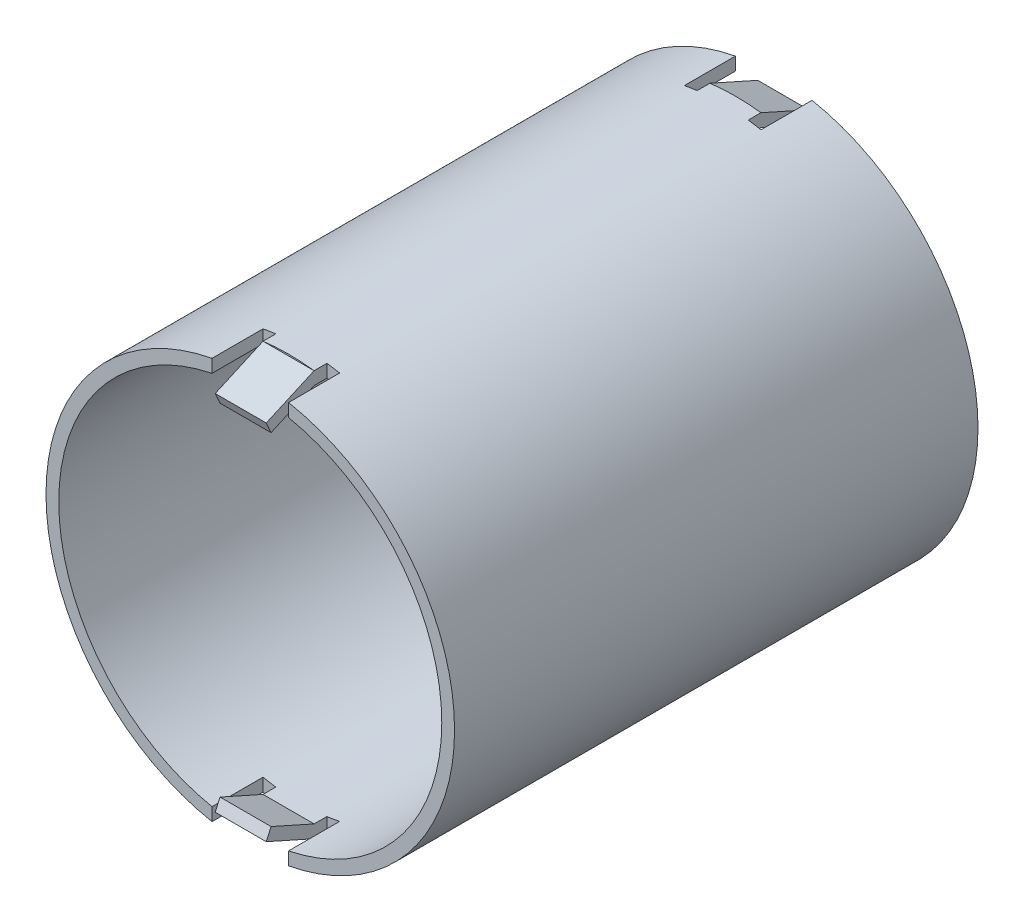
ISO-10303-21;
HEADER;
FILE_DESCRIPTION(('STEP AP214'),'2;1');
FILE_NAME('part.step','',(''),(''),'','','');
FILE_SCHEMA(('AUTOMOTIVE_DESIGN { 1 0 10303 214 1 1 1 1 }'));
ENDSEC;
DATA;
#1=APPLICATION_CONTEXT('core data for automotive mechanical design processes');
#2=APPLICATION_PROTOCOL_DEFINITION('international standard','automotive_design',2000,#1);
#3=PRODUCT_CONTEXT('',#1,'mechanical');
#4=PRODUCT('Part','Part','',(#3));
#5=PRODUCT_RELATED_PRODUCT_CATEGORY('part','',(#4));
#6=PRODUCT_DEFINITION_FORMATION('','',#4);
#7=PRODUCT_DEFINITION_CONTEXT('part definition',#1,'design');
#8=PRODUCT_DEFINITION('design','',#6,#7);
#9=PRODUCT_DEFINITION_SHAPE('','',#8);
#10=(LENGTH_UNIT() NAMED_UNIT(*) SI_UNIT(.MILLI.,.METRE.));
#11=(NAMED_UNIT(*) PLANE_ANGLE_UNIT() SI_UNIT($,.RADIAN.));
#12=(NAMED_UNIT(*) SI_UNIT($,.STERADIAN.) SOLID_ANGLE_UNIT());
#13=UNCERTAINTY_MEASURE_WITH_UNIT(LENGTH_MEASURE(1.E-05),#10,'distance_accuracy_value','');
#14=(GEOMETRIC_REPRESENTATION_CONTEXT(3) GLOBAL_UNCERTAINTY_ASSIGNED_CONTEXT((#13)) GLOBAL_UNIT_ASSIGNED_CONTEXT((#10,
#11,#12)) REPRESENTATION_CONTEXT('',''));
#15=CARTESIAN_POINT('',(0.,0.,0.));
#16=DIRECTION('',(0.,0.,1.));
#17=DIRECTION('',(1.,0.,0.));
#18=AXIS2_PLACEMENT_3D('',#15,#16,#17);
#19=CARTESIAN_POINT('',(-2.,-16.,38.));
#20=DIRECTION('',(0.,0.,1.));
#21=DIRECTION('',(1.,0.,0.));
#22=AXIS2_PLACEMENT_3D('',#19,#20,#21);
#23=PLANE('',#22);
#24=CARTESIAN_POINT('',(0.,0.,38.));
#25=DIRECTION('',(0.,0.,1.));
#26=DIRECTION('',(1.,0.,0.));
#27=AXIS2_PLACEMENT_3D('',#24,#25,#26);
#28=CIRCLE('',#27,16.);
#29=CARTESIAN_POINT('',(-1.9999999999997,-15.8745078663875,38.));
#30=VERTEX_POINT('',#29);
#31=CARTESIAN_POINT('',(2.0000000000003,-15.8745078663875,38.));
#32=VERTEX_POINT('',#31);
#33=EDGE_CURVE('E300',#30,#32,#28,.T.);
#34=ORIENTED_EDGE('',*,*,#33,.T.);
#35=DIRECTION('',(-1.,0.,0.));
#36=VECTOR('',#35,1.);
#37=CARTESIAN_POINT('',(2.0000000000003,-15.8745078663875,38.));
#38=LINE('',#37,#36);
#39=EDGE_CURVE('E289',#32,#30,#38,.T.);
#40=ORIENTED_EDGE('',*,*,#39,.T.);
#41=EDGE_LOOP('',(#34,#40));
#42=FACE_BOUND('',#41,.T.);
#43=ADVANCED_FACE('F27',(#42),#23,.T.);
#44=CARTESIAN_POINT('',(2.,15.8745078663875,38.));
#45=VERTEX_POINT('',#44);
#46=CARTESIAN_POINT('',(-2.,15.8745078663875,38.));
#47=VERTEX_POINT('',#46);
#48=EDGE_CURVE('E313',#45,#47,#28,.T.);
#49=ORIENTED_EDGE('',*,*,#48,.T.);
#50=DIRECTION('',(1.,0.,0.));
#51=VECTOR('',#50,1.);
#52=CARTESIAN_POINT('',(-2.,15.8745078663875,38.));
#53=LINE('',#52,#51);
#54=EDGE_CURVE('E478',#47,#45,#53,.T.);
#55=ORIENTED_EDGE('',*,*,#54,.T.);
#56=EDGE_LOOP('',(#49,#55));
#57=FACE_BOUND('',#56,.T.);
#58=ADVANCED_FACE('F595',(#57),#23,.T.);
#59=CARTESIAN_POINT('',(0.,0.,41.));
#60=DIRECTION('',(0.,0.,1.));
#61=DIRECTION('',(1.,0.,0.));
#62=AXIS2_PLACEMENT_3D('',#59,#60,#61);
#63=PLANE('',#62);
#64=CARTESIAN_POINT('',(0.,0.,41.));
#65=DIRECTION('',(0.,0.,1.));
#66=DIRECTION('',(1.,0.,0.));
#67=AXIS2_PLACEMENT_3D('',#64,#65,#66);
#68=CIRCLE('',#67,16.);
#69=CARTESIAN_POINT('',(-2.99999999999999,15.7162336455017,41.));
#70=VERTEX_POINT('',#69);
#71=CARTESIAN_POINT('',(-2.99999999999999,-15.7162336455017,41.));
#72=VERTEX_POINT('',#71);
#73=EDGE_CURVE('E405',#70,#72,#68,.T.);
#74=ORIENTED_EDGE('',*,*,#73,.T.);
#75=DIRECTION('',(0.,1.,0.));
#76=VECTOR('',#75,1.);
#77=CARTESIAN_POINT('',(-2.99999999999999,-16.,41.));
#78=LINE('',#77,#76);
#79=CARTESIAN_POINT('',(-2.99999999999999,-14.6969384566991,41.));
#80=VERTEX_POINT('',#79);
#81=EDGE_CURVE('E573',#72,#80,#78,.T.);
#82=ORIENTED_EDGE('',*,*,#81,.T.);
#83=CARTESIAN_POINT('',(0.,0.,41.));
#84=DIRECTION('',(0.,0.,1.));
#85=DIRECTION('',(1.,0.,0.));
#86=AXIS2_PLACEMENT_3D('',#83,#84,#85);
#87=CIRCLE('',#86,15.);
#88=CARTESIAN_POINT('',(-2.99999999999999,14.6969384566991,41.));
#89=VERTEX_POINT('',#88);
#90=EDGE_CURVE('E397',#89,#80,#87,.T.);
#91=ORIENTED_EDGE('',*,*,#90,.F.);
#92=EDGE_CURVE('E551',#89,#70,#78,.T.);
#93=ORIENTED_EDGE('',*,*,#92,.T.);
#94=EDGE_LOOP('',(#74,#82,#91,#93));
#95=FACE_BOUND('',#94,.T.);
#96=ADVANCED_FACE('F646',(#95),#63,.T.);
#97=CARTESIAN_POINT('',(2.99999999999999,-15.7162336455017,41.));
#98=VERTEX_POINT('',#97);
#99=CARTESIAN_POINT('',(2.99999999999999,15.7162336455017,41.));
#100=VERTEX_POINT('',#99);
#101=EDGE_CURVE('E402',#98,#100,#68,.T.);
#102=ORIENTED_EDGE('',*,*,#101,.T.);
#103=DIRECTION('',(0.,1.,0.));
#104=VECTOR('',#103,1.);
#105=CARTESIAN_POINT('',(2.99999999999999,-16.,41.));
#106=LINE('',#105,#104);
#107=CARTESIAN_POINT('',(2.99999999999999,14.6969384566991,41.));
#108=VERTEX_POINT('',#107);
#109=EDGE_CURVE('E571',#108,#100,#106,.T.);
#110=ORIENTED_EDGE('',*,*,#109,.F.);
#111=CARTESIAN_POINT('',(2.99999999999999,-14.6969384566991,41.));
#112=VERTEX_POINT('',#111);
#113=EDGE_CURVE('E394',#112,#108,#87,.T.);
#114=ORIENTED_EDGE('',*,*,#113,.F.);
#115=EDGE_CURVE('E50',#98,#112,#106,.T.);
#116=ORIENTED_EDGE('',*,*,#115,.F.);
#117=EDGE_LOOP('',(#102,#110,#114,#116));
#118=FACE_BOUND('',#117,.T.);
#119=ADVANCED_FACE('F710',(#118),#63,.T.);
#120=CARTESIAN_POINT('',(0.,0.,41.));
#121=DIRECTION('',(0.,0.,-1.));
#122=DIRECTION('',(-1.,0.,0.));
#123=AXIS2_PLACEMENT_3D('',#120,#121,#122);
#124=CYLINDRICAL_SURFACE('',#123,16.);
#125=CARTESIAN_POINT('',(0.,0.,0.));
#126=DIRECTION('',(0.,0.,1.));
#127=DIRECTION('',(1.,0.,0.));
#128=AXIS2_PLACEMENT_3D('',#125,#126,#127);
#129=CIRCLE('',#128,16.);
#130=CARTESIAN_POINT('',(2.99999999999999,-15.7162336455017,0.));
#131=VERTEX_POINT('',#130);
#132=CARTESIAN_POINT('',(2.99999999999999,15.7162336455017,0.));
#133=VERTEX_POINT('',#132);
#134=EDGE_CURVE('E398',#131,#133,#129,.T.);
#135=ORIENTED_EDGE('',*,*,#134,.T.);
#136=DIRECTION('',(0.,0.,-1.));
#137=VECTOR('',#136,1.);
#138=CARTESIAN_POINT('',(2.99999999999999,15.7162336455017,41.));
#139=LINE('',#138,#137);
#140=CARTESIAN_POINT('',(2.99999999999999,15.7162336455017,4.));
#141=VERTEX_POINT('',#140);
#142=EDGE_CURVE('E378',#133,#141,#139,.F.);
#143=ORIENTED_EDGE('',*,*,#142,.T.);
#144=CARTESIAN_POINT('',(0.,0.,4.));
#145=DIRECTION('',(0.,0.,1.));
#146=DIRECTION('',(1.,0.,0.));
#147=AXIS2_PLACEMENT_3D('',#144,#145,#146);
#148=CIRCLE('',#147,16.);
#149=CARTESIAN_POINT('',(2.,15.8745078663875,3.99999999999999));
#150=VERTEX_POINT('',#149);
#151=EDGE_CURVE('E377',#141,#150,#148,.T.);
#152=ORIENTED_EDGE('',*,*,#151,.T.);
#153=DIRECTION('',(0.,0.,-1.));
#154=VECTOR('',#153,1.);
#155=CARTESIAN_POINT('',(2.00000000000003,15.8745078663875,41.));
#156=LINE('',#155,#154);
#157=CARTESIAN_POINT('',(2.,15.8745078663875,3.));
#158=VERTEX_POINT('',#157);
#159=EDGE_CURVE('E371',#150,#158,#156,.T.);
#160=ORIENTED_EDGE('',*,*,#159,.T.);
#161=CARTESIAN_POINT('',(0.,0.,3.));
#162=DIRECTION('',(0.,0.,1.));
#163=DIRECTION('',(1.,0.,0.));
#164=AXIS2_PLACEMENT_3D('',#161,#162,#163);
#165=CIRCLE('',#164,16.);
#166=CARTESIAN_POINT('',(-2.,15.8745078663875,3.));
#167=VERTEX_POINT('',#166);
#168=EDGE_CURVE('E365',#158,#167,#165,.T.);
#169=ORIENTED_EDGE('',*,*,#168,.T.);
#170=DIRECTION('',(0.,0.,-1.));
#171=VECTOR('',#170,1.);
#172=CARTESIAN_POINT('',(-2.,15.8745078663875,41.));
#173=LINE('',#172,#171);
#174=CARTESIAN_POINT('',(-2.,15.8745078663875,3.99999999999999));
#175=VERTEX_POINT('',#174);
#176=EDGE_CURVE('E358',#167,#175,#173,.F.);
#177=ORIENTED_EDGE('',*,*,#176,.T.);
#178=CARTESIAN_POINT('',(0.,0.,3.99999999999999));
#179=DIRECTION('',(0.,0.,1.));
#180=DIRECTION('',(1.,0.,0.));
#181=AXIS2_PLACEMENT_3D('',#178,#179,#180);
#182=CIRCLE('',#181,16.);
#183=CARTESIAN_POINT('',(-2.99999999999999,15.7162336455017,3.99999999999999));
#184=VERTEX_POINT('',#183);
#185=EDGE_CURVE('E357',#175,#184,#182,.T.);
#186=ORIENTED_EDGE('',*,*,#185,.T.);
#187=DIRECTION('',(0.,0.,-1.));
#188=VECTOR('',#187,1.);
#189=CARTESIAN_POINT('',(-2.99999999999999,15.7162336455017,41.));
#190=LINE('',#189,#188);
#191=CARTESIAN_POINT('',(-2.99999999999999,15.7162336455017,0.));
#192=VERTEX_POINT('',#191);
#193=EDGE_CURVE('E387',#184,#192,#190,.T.);
#194=ORIENTED_EDGE('',*,*,#193,.T.);
#195=CARTESIAN_POINT('',(-2.99999999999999,-15.7162336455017,0.));
#196=VERTEX_POINT('',#195);
#197=EDGE_CURVE('E401',#192,#196,#129,.T.);
#198=ORIENTED_EDGE('',*,*,#197,.T.);
#199=DIRECTION('',(0.,0.,-1.));
#200=VECTOR('',#199,1.);
#201=CARTESIAN_POINT('',(-2.99999999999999,-15.7162336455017,41.));
#202=LINE('',#201,#200);
#203=CARTESIAN_POINT('',(-2.99999999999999,-15.7162336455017,3.99999999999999));
#204=VERTEX_POINT('',#203);
#205=EDGE_CURVE('E384',#196,#204,#202,.F.);
#206=ORIENTED_EDGE('',*,*,#205,.T.);
#207=CARTESIAN_POINT('',(-2.,-15.8745078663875,3.99999999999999));
#208=VERTEX_POINT('',#207);
#209=EDGE_CURVE('E354',#204,#208,#182,.T.);
#210=ORIENTED_EDGE('',*,*,#209,.T.);
#211=DIRECTION('',(0.,0.,-1.));
#212=VECTOR('',#211,1.);
#213=CARTESIAN_POINT('',(-2.,-15.8745078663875,41.));
#214=LINE('',#213,#212);
#215=CARTESIAN_POINT('',(-1.9999999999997,-15.8745078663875,3.));
#216=VERTEX_POINT('',#215);
#217=EDGE_CURVE('E361',#208,#216,#214,.T.);
#218=ORIENTED_EDGE('',*,*,#217,.T.);
#219=CARTESIAN_POINT('',(2.0000000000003,-15.8745078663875,3.));
#220=VERTEX_POINT('',#219);
#221=EDGE_CURVE('E364',#216,#220,#165,.T.);
#222=ORIENTED_EDGE('',*,*,#221,.T.);
#223=DIRECTION('',(0.,0.,-1.));
#224=VECTOR('',#223,1.);
#225=CARTESIAN_POINT('',(2.00000000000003,-15.8745078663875,41.));
#226=LINE('',#225,#224);
#227=CARTESIAN_POINT('',(2.,-15.8745078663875,3.99999999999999));
#228=VERTEX_POINT('',#227);
#229=EDGE_CURVE('E368',#220,#228,#226,.F.);
#230=ORIENTED_EDGE('',*,*,#229,.T.);
#231=CARTESIAN_POINT('',(2.99999999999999,-15.7162336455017,4.));
#232=VERTEX_POINT('',#231);
#233=EDGE_CURVE('E374',#228,#232,#148,.T.);
#234=ORIENTED_EDGE('',*,*,#233,.T.);
#235=DIRECTION('',(0.,0.,-1.));
#236=VECTOR('',#235,1.);
#237=CARTESIAN_POINT('',(2.99999999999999,-15.7162336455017,41.));
#238=LINE('',#237,#236);
#239=EDGE_CURVE('E381',#232,#131,#238,.T.);
#240=ORIENTED_EDGE('',*,*,#239,.T.);
#241=EDGE_LOOP('',(#135,#143,#152,#160,#169,#177,#186,#194,#198,#206,#210,#218,#222,#230,#234,#240));
#242=FACE_BOUND('',#241,.T.);
#243=DIRECTION('',(0.,0.,-1.));
#244=VECTOR('',#243,1.);
#245=CARTESIAN_POINT('',(-2.99999999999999,-15.7162336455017,41.));
#246=LINE('',#245,#244);
#247=CARTESIAN_POINT('',(-2.99999999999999,-15.7162336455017,37.));
#248=VERTEX_POINT('',#247);
#249=EDGE_CURVE('E329',#72,#248,#246,.T.);
#250=ORIENTED_EDGE('',*,*,#249,.F.);
#251=ORIENTED_EDGE('',*,*,#73,.F.);
#252=DIRECTION('',(0.,0.,-1.));
#253=VECTOR('',#252,1.);
#254=CARTESIAN_POINT('',(-2.99999999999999,15.7162336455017,41.));
#255=LINE('',#254,#253);
#256=CARTESIAN_POINT('',(-2.99999999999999,15.7162336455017,37.));
#257=VERTEX_POINT('',#256);
#258=EDGE_CURVE('E327',#257,#70,#255,.F.);
#259=ORIENTED_EDGE('',*,*,#258,.F.);
#260=CARTESIAN_POINT('',(0.,0.,37.));
#261=DIRECTION('',(0.,0.,1.));
#262=DIRECTION('',(1.,0.,0.));
#263=AXIS2_PLACEMENT_3D('',#260,#261,#262);
#264=CIRCLE('',#263,16.);
#265=CARTESIAN_POINT('',(-2.,15.8745078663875,37.));
#266=VERTEX_POINT('',#265);
#267=EDGE_CURVE('E326',#266,#257,#264,.T.);
#268=ORIENTED_EDGE('',*,*,#267,.F.);
#269=DIRECTION('',(0.,0.,-1.));
#270=VECTOR('',#269,1.);
#271=CARTESIAN_POINT('',(-2.,15.8745078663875,41.));
#272=LINE('',#271,#270);
#273=EDGE_CURVE('E312',#47,#266,#272,.T.);
#274=ORIENTED_EDGE('',*,*,#273,.F.);
#275=ORIENTED_EDGE('',*,*,#48,.F.);
#276=DIRECTION('',(0.,0.,-1.));
#277=VECTOR('',#276,1.);
#278=CARTESIAN_POINT('',(1.99999999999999,15.8745078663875,41.));
#279=LINE('',#278,#277);
#280=CARTESIAN_POINT('',(2.,15.8745078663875,37.));
#281=VERTEX_POINT('',#280);
#282=EDGE_CURVE('E319',#281,#45,#279,.F.);
#283=ORIENTED_EDGE('',*,*,#282,.F.);
#284=CARTESIAN_POINT('',(0.,0.,37.));
#285=DIRECTION('',(0.,0.,1.));
#286=DIRECTION('',(1.,0.,0.));
#287=AXIS2_PLACEMENT_3D('',#284,#285,#286);
#288=CIRCLE('',#287,16.);
#289=CARTESIAN_POINT('',(2.99999999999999,15.7162336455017,37.));
#290=VERTEX_POINT('',#289);
#291=EDGE_CURVE('E581',#290,#281,#288,.T.);
#292=ORIENTED_EDGE('',*,*,#291,.F.);
#293=DIRECTION('',(0.,0.,-1.));
#294=VECTOR('',#293,1.);
#295=CARTESIAN_POINT('',(2.99999999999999,15.7162336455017,41.));
#296=LINE('',#295,#294);
#297=EDGE_CURVE('E578',#100,#290,#296,.T.);
#298=ORIENTED_EDGE('',*,*,#297,.F.);
#299=ORIENTED_EDGE('',*,*,#101,.F.);
#300=DIRECTION('',(0.,0.,-1.));
#301=VECTOR('',#300,1.);
#302=CARTESIAN_POINT('',(2.99999999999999,-15.7162336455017,41.));
#303=LINE('',#302,#301);
#304=CARTESIAN_POINT('',(2.99999999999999,-15.7162336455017,37.));
#305=VERTEX_POINT('',#304);
#306=EDGE_CURVE('E576',#305,#98,#303,.F.);
#307=ORIENTED_EDGE('',*,*,#306,.F.);
#308=CARTESIAN_POINT('',(2.,-15.8745078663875,37.));
#309=VERTEX_POINT('',#308);
#310=EDGE_CURVE('E580',#309,#305,#288,.T.);
#311=ORIENTED_EDGE('',*,*,#310,.F.);
#312=DIRECTION('',(0.,0.,-1.));
#313=VECTOR('',#312,1.);
#314=CARTESIAN_POINT('',(1.99999999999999,-15.8745078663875,41.));
#315=LINE('',#314,#313);
#316=EDGE_CURVE('E317',#32,#309,#315,.T.);
#317=ORIENTED_EDGE('',*,*,#316,.F.);
#318=ORIENTED_EDGE('',*,*,#33,.F.);
#319=DIRECTION('',(0.,0.,-1.));
#320=VECTOR('',#319,1.);
#321=CARTESIAN_POINT('',(-2.,-15.8745078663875,41.));
#322=LINE('',#321,#320);
#323=CARTESIAN_POINT('',(-2.,-15.8745078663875,37.));
#324=VERTEX_POINT('',#323);
#325=EDGE_CURVE('E306',#324,#30,#322,.F.);
#326=ORIENTED_EDGE('',*,*,#325,.F.);
#327=EDGE_CURVE('E324',#248,#324,#264,.T.);
#328=ORIENTED_EDGE('',*,*,#327,.F.);
#329=EDGE_LOOP('',(#250,#251,#259,#268,#274,#275,#283,#292,#298,#299,#307,#311,#317,#318,#326,#328));
#330=FACE_BOUND('',#329,.T.);
#331=ADVANCED_FACE('F29',(#242,#330),#124,.T.);
#332=CARTESIAN_POINT('',(0.,0.,41.));
#333=DIRECTION('',(0.,0.,-1.));
#334=DIRECTION('',(-1.,0.,0.));
#335=AXIS2_PLACEMENT_3D('',#332,#333,#334);
#336=CYLINDRICAL_SURFACE('',#335,15.);
#337=DIRECTION('',(0.,0.,-1.));
#338=VECTOR('',#337,1.);
#339=CARTESIAN_POINT('',(-2.99999999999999,14.6969384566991,41.));
#340=LINE('',#339,#338);
#341=CARTESIAN_POINT('',(-2.99999999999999,14.6969384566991,3.99999999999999));
#342=VERTEX_POINT('',#341);
#343=CARTESIAN_POINT('',(-2.99999999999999,14.6969384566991,0.));
#344=VERTEX_POINT('',#343);
#345=EDGE_CURVE('E433',#342,#344,#340,.T.);
#346=ORIENTED_EDGE('',*,*,#345,.F.);
#347=CARTESIAN_POINT('',(0.,0.,3.99999999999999));
#348=DIRECTION('',(0.,0.,1.));
#349=DIRECTION('',(1.,0.,0.));
#350=AXIS2_PLACEMENT_3D('',#347,#348,#349);
#351=CIRCLE('',#350,15.);
#352=CARTESIAN_POINT('',(-2.,14.8660687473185,3.99999999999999));
#353=VERTEX_POINT('',#352);
#354=EDGE_CURVE('E409',#353,#342,#351,.T.);
#355=ORIENTED_EDGE('',*,*,#354,.F.);
#356=DIRECTION('',(0.,0.,-1.));
#357=VECTOR('',#356,1.);
#358=CARTESIAN_POINT('',(-2.,14.8660687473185,41.));
#359=LINE('',#358,#357);
#360=CARTESIAN_POINT('',(-2.,14.8660687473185,2.99999999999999));
#361=VERTEX_POINT('',#360);
#362=EDGE_CURVE('E426',#361,#353,#359,.F.);
#363=ORIENTED_EDGE('',*,*,#362,.F.);
#364=CARTESIAN_POINT('',(0.,0.,3.));
#365=DIRECTION('',(0.,0.,1.));
#366=DIRECTION('',(1.,0.,0.));
#367=AXIS2_PLACEMENT_3D('',#364,#365,#366);
#368=CIRCLE('',#367,15.);
#369=CARTESIAN_POINT('',(2.,14.8660687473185,3.));
#370=VERTEX_POINT('',#369);
#371=EDGE_CURVE('E416',#370,#361,#368,.T.);
#372=ORIENTED_EDGE('',*,*,#371,.F.);
#373=DIRECTION('',(0.,0.,-1.));
#374=VECTOR('',#373,1.);
#375=CARTESIAN_POINT('',(2.00000000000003,14.8660687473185,41.));
#376=LINE('',#375,#374);
#377=CARTESIAN_POINT('',(2.,14.8660687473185,3.99999999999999));
#378=VERTEX_POINT('',#377);
#379=EDGE_CURVE('E429',#378,#370,#376,.T.);
#380=ORIENTED_EDGE('',*,*,#379,.F.);
#381=CARTESIAN_POINT('',(0.,0.,4.));
#382=DIRECTION('',(0.,0.,1.));
#383=DIRECTION('',(1.,0.,0.));
#384=AXIS2_PLACEMENT_3D('',#381,#382,#383);
#385=CIRCLE('',#384,15.);
#386=CARTESIAN_POINT('',(2.99999999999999,14.6969384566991,4.));
#387=VERTEX_POINT('',#386);
#388=EDGE_CURVE('E421',#387,#378,#385,.T.);
#389=ORIENTED_EDGE('',*,*,#388,.F.);
#390=DIRECTION('',(0.,0.,-1.));
#391=VECTOR('',#390,1.);
#392=CARTESIAN_POINT('',(2.99999999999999,14.6969384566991,41.));
#393=LINE('',#392,#391);
#394=CARTESIAN_POINT('',(2.99999999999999,14.6969384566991,0.));
#395=VERTEX_POINT('',#394);
#396=EDGE_CURVE('E431',#395,#387,#393,.F.);
#397=ORIENTED_EDGE('',*,*,#396,.F.);
#398=CARTESIAN_POINT('',(0.,0.,0.));
#399=DIRECTION('',(0.,0.,1.));
#400=DIRECTION('',(1.,0.,0.));
#401=AXIS2_PLACEMENT_3D('',#398,#399,#400);
#402=CIRCLE('',#401,15.);
#403=CARTESIAN_POINT('',(2.99999999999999,-14.6969384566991,0.));
#404=VERTEX_POINT('',#403);
#405=EDGE_CURVE('E390',#404,#395,#402,.T.);
#406=ORIENTED_EDGE('',*,*,#405,.F.);
#407=DIRECTION('',(0.,0.,-1.));
#408=VECTOR('',#407,1.);
#409=CARTESIAN_POINT('',(2.99999999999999,-14.6969384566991,41.));
#410=LINE('',#409,#408);
#411=CARTESIAN_POINT('',(2.99999999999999,-14.6969384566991,4.));
#412=VERTEX_POINT('',#411);
#413=EDGE_CURVE('E420',#412,#404,#410,.T.);
#414=ORIENTED_EDGE('',*,*,#413,.F.);
#415=CARTESIAN_POINT('',(2.,-14.8660687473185,3.99999999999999));
#416=VERTEX_POINT('',#415);
#417=EDGE_CURVE('E418',#416,#412,#385,.T.);
#418=ORIENTED_EDGE('',*,*,#417,.F.);
#419=DIRECTION('',(0.,0.,-1.));
#420=VECTOR('',#419,1.);
#421=CARTESIAN_POINT('',(2.00000000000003,-14.8660687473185,41.));
#422=LINE('',#421,#420);
#423=CARTESIAN_POINT('',(2.,-14.8660687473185,3.));
#424=VERTEX_POINT('',#423);
#425=EDGE_CURVE('E415',#424,#416,#422,.F.);
#426=ORIENTED_EDGE('',*,*,#425,.F.);
#427=CARTESIAN_POINT('',(-1.99999999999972,-14.8660687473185,3.));
#428=VERTEX_POINT('',#427);
#429=EDGE_CURVE('E412',#428,#424,#368,.T.);
#430=ORIENTED_EDGE('',*,*,#429,.F.);
#431=DIRECTION('',(0.,0.,-1.));
#432=VECTOR('',#431,1.);
#433=CARTESIAN_POINT('',(-2.,-14.8660687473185,41.));
#434=LINE('',#433,#432);
#435=CARTESIAN_POINT('',(-2.,-14.8660687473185,3.99999999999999));
#436=VERTEX_POINT('',#435);
#437=EDGE_CURVE('E408',#436,#428,#434,.T.);
#438=ORIENTED_EDGE('',*,*,#437,.F.);
#439=CARTESIAN_POINT('',(-2.99999999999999,-14.6969384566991,3.99999999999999));
#440=VERTEX_POINT('',#439);
#441=EDGE_CURVE('E406',#440,#436,#351,.T.);
#442=ORIENTED_EDGE('',*,*,#441,.F.);
#443=DIRECTION('',(0.,0.,-1.));
#444=VECTOR('',#443,1.);
#445=CARTESIAN_POINT('',(-2.99999999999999,-14.6969384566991,41.));
#446=LINE('',#445,#444);
#447=CARTESIAN_POINT('',(-2.99999999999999,-14.6969384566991,0.));
#448=VERTEX_POINT('',#447);
#449=EDGE_CURVE('E423',#448,#440,#446,.F.);
#450=ORIENTED_EDGE('',*,*,#449,.F.);
#451=EDGE_CURVE('E393',#344,#448,#402,.T.);
#452=ORIENTED_EDGE('',*,*,#451,.F.);
#453=EDGE_LOOP('',(#346,#355,#363,#372,#380,#389,#397,#406,#414,#418,#426,#430,#438,#442,#450,#452));
#454=FACE_BOUND('',#453,.T.);
#455=CARTESIAN_POINT('',(0.,0.,37.));
#456=DIRECTION('',(0.,0.,1.));
#457=DIRECTION('',(1.,0.,0.));
#458=AXIS2_PLACEMENT_3D('',#455,#456,#457);
#459=CIRCLE('',#458,15.);
#460=CARTESIAN_POINT('',(-2.,14.8660687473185,37.));
#461=VERTEX_POINT('',#460);
#462=CARTESIAN_POINT('',(-2.99999999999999,14.6969384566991,37.));
#463=VERTEX_POINT('',#462);
#464=EDGE_CURVE('E35',#461,#463,#459,.T.);
#465=ORIENTED_EDGE('',*,*,#464,.T.);
#466=DIRECTION('',(0.,0.,-1.));
#467=VECTOR('',#466,1.);
#468=CARTESIAN_POINT('',(-2.99999999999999,14.6969384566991,41.));
#469=LINE('',#468,#467);
#470=EDGE_CURVE('E11',#463,#89,#469,.F.);
#471=ORIENTED_EDGE('',*,*,#470,.T.);
#472=ORIENTED_EDGE('',*,*,#90,.T.);
#473=DIRECTION('',(0.,0.,-1.));
#474=VECTOR('',#473,1.);
#475=CARTESIAN_POINT('',(-2.99999999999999,-14.6969384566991,41.));
#476=LINE('',#475,#474);
#477=CARTESIAN_POINT('',(-2.99999999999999,-14.6969384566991,37.));
#478=VERTEX_POINT('',#477);
#479=EDGE_CURVE('E454',#80,#478,#476,.T.);
#480=ORIENTED_EDGE('',*,*,#479,.T.);
#481=CARTESIAN_POINT('',(-2.,-14.8660687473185,37.));
#482=VERTEX_POINT('',#481);
#483=EDGE_CURVE('E451',#478,#482,#459,.T.);
#484=ORIENTED_EDGE('',*,*,#483,.T.);
#485=DIRECTION('',(0.,0.,-1.));
#486=VECTOR('',#485,1.);
#487=CARTESIAN_POINT('',(-2.,-14.8660687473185,41.));
#488=LINE('',#487,#486);
#489=CARTESIAN_POINT('',(-2.,-14.8660687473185,38.));
#490=VERTEX_POINT('',#489);
#491=EDGE_CURVE('E447',#482,#490,#488,.F.);
#492=ORIENTED_EDGE('',*,*,#491,.T.);
#493=CARTESIAN_POINT('',(0.,0.,38.));
#494=DIRECTION('',(0.,0.,1.));
#495=DIRECTION('',(1.,0.,0.));
#496=AXIS2_PLACEMENT_3D('',#493,#494,#495);
#497=CIRCLE('',#496,15.);
#498=CARTESIAN_POINT('',(2.00000000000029,-14.8660687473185,38.));
#499=VERTEX_POINT('',#498);
#500=EDGE_CURVE('E444',#490,#499,#497,.T.);
#501=ORIENTED_EDGE('',*,*,#500,.T.);
#502=DIRECTION('',(0.,0.,-1.));
#503=VECTOR('',#502,1.);
#504=CARTESIAN_POINT('',(1.99999999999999,-14.8660687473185,41.));
#505=LINE('',#504,#503);
#506=CARTESIAN_POINT('',(2.,-14.8660687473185,37.));
#507=VERTEX_POINT('',#506);
#508=EDGE_CURVE('E440',#499,#507,#505,.T.);
#509=ORIENTED_EDGE('',*,*,#508,.T.);
#510=CARTESIAN_POINT('',(0.,0.,37.));
#511=DIRECTION('',(0.,0.,1.));
#512=DIRECTION('',(1.,0.,0.));
#513=AXIS2_PLACEMENT_3D('',#510,#511,#512);
#514=CIRCLE('',#513,15.);
#515=CARTESIAN_POINT('',(2.99999999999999,-14.6969384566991,37.));
#516=VERTEX_POINT('',#515);
#517=EDGE_CURVE('E437',#507,#516,#514,.T.);
#518=ORIENTED_EDGE('',*,*,#517,.T.);
#519=DIRECTION('',(0.,0.,-1.));
#520=VECTOR('',#519,1.);
#521=CARTESIAN_POINT('',(2.99999999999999,-14.6969384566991,41.));
#522=LINE('',#521,#520);
#523=EDGE_CURVE('E435',#516,#112,#522,.F.);
#524=ORIENTED_EDGE('',*,*,#523,.T.);
#525=ORIENTED_EDGE('',*,*,#113,.T.);
#526=DIRECTION('',(0.,0.,-1.));
#527=VECTOR('',#526,1.);
#528=CARTESIAN_POINT('',(2.99999999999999,14.6969384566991,41.));
#529=LINE('',#528,#527);
#530=CARTESIAN_POINT('',(2.99999999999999,14.6969384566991,37.));
#531=VERTEX_POINT('',#530);
#532=EDGE_CURVE('E457',#108,#531,#529,.T.);
#533=ORIENTED_EDGE('',*,*,#532,.T.);
#534=CARTESIAN_POINT('',(2.,14.8660687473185,37.));
#535=VERTEX_POINT('',#534);
#536=EDGE_CURVE('E441',#531,#535,#514,.T.);
#537=ORIENTED_EDGE('',*,*,#536,.T.);
#538=DIRECTION('',(0.,0.,-1.));
#539=VECTOR('',#538,1.);
#540=CARTESIAN_POINT('',(1.99999999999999,14.8660687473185,41.));
#541=LINE('',#540,#539);
#542=CARTESIAN_POINT('',(2.,14.8660687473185,38.));
#543=VERTEX_POINT('',#542);
#544=EDGE_CURVE('E460',#535,#543,#541,.F.);
#545=ORIENTED_EDGE('',*,*,#544,.T.);
#546=CARTESIAN_POINT('',(-2.,14.8660687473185,38.));
#547=VERTEX_POINT('',#546);
#548=EDGE_CURVE('E448',#543,#547,#497,.T.);
#549=ORIENTED_EDGE('',*,*,#548,.T.);
#550=DIRECTION('',(0.,0.,-1.));
#551=VECTOR('',#550,1.);
#552=CARTESIAN_POINT('',(-2.,14.8660687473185,41.));
#553=LINE('',#552,#551);
#554=EDGE_CURVE('E461',#547,#461,#553,.T.);
#555=ORIENTED_EDGE('',*,*,#554,.T.);
#556=EDGE_LOOP('',(#465,#471,#472,#480,#484,#492,#501,#509,#518,#524,#525,#533,#537,#545,#549,#555));
#557=FACE_BOUND('',#556,.T.);
#558=ADVANCED_FACE('F468',(#454,#557),#336,.F.);
#559=CARTESIAN_POINT('',(0.,0.,0.));
#560=DIRECTION('',(0.,0.,1.));
#561=DIRECTION('',(1.,0.,0.));
#562=AXIS2_PLACEMENT_3D('',#559,#560,#561);
#563=PLANE('',#562);
#564=ORIENTED_EDGE('',*,*,#197,.F.);
#565=DIRECTION('',(0.,1.,0.));
#566=VECTOR('',#565,1.);
#567=CARTESIAN_POINT('',(-2.99999999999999,-16.,0.));
#568=LINE('',#567,#566);
#569=EDGE_CURVE('E332',#344,#192,#568,.T.);
#570=ORIENTED_EDGE('',*,*,#569,.F.);
#571=ORIENTED_EDGE('',*,*,#451,.T.);
#572=EDGE_CURVE('E334',#196,#448,#568,.T.);
#573=ORIENTED_EDGE('',*,*,#572,.F.);
#574=EDGE_LOOP('',(#564,#570,#571,#573));
#575=FACE_BOUND('',#574,.T.);
#576=ADVANCED_FACE('F704',(#575),#563,.F.);
#577=ORIENTED_EDGE('',*,*,#134,.F.);
#578=DIRECTION('',(0.,1.,0.));
#579=VECTOR('',#578,1.);
#580=CARTESIAN_POINT('',(2.99999999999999,-16.,0.));
#581=LINE('',#580,#579);
#582=EDGE_CURVE('E335',#131,#404,#581,.T.);
#583=ORIENTED_EDGE('',*,*,#582,.T.);
#584=ORIENTED_EDGE('',*,*,#405,.T.);
#585=EDGE_CURVE('E336',#395,#133,#581,.T.);
#586=ORIENTED_EDGE('',*,*,#585,.T.);
#587=EDGE_LOOP('',(#577,#583,#584,#586));
#588=FACE_BOUND('',#587,.T.);
#589=ADVANCED_FACE('F706',(#588),#563,.F.);
#590=CARTESIAN_POINT('',(-2.99999999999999,-16.,3.99999999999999));
#591=DIRECTION('',(0.,0.,1.));
#592=DIRECTION('',(1.,0.,0.));
#593=AXIS2_PLACEMENT_3D('',#590,#591,#592);
#594=PLANE('',#593);
#595=DIRECTION('',(0.,1.,0.));
#596=VECTOR('',#595,1.);
#597=CARTESIAN_POINT('',(-2.99999999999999,-16.,3.99999999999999));
#598=LINE('',#597,#596);
#599=EDGE_CURVE('E351',#204,#440,#598,.T.);
#600=ORIENTED_EDGE('',*,*,#599,.T.);
#601=ORIENTED_EDGE('',*,*,#441,.T.);
#602=DIRECTION('',(0.,1.,0.));
#603=VECTOR('',#602,1.);
#604=CARTESIAN_POINT('',(-2.,-16.,3.99999999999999));
#605=LINE('',#604,#603);
#606=EDGE_CURVE('E347',#208,#436,#605,.T.);
#607=ORIENTED_EDGE('',*,*,#606,.F.);
#608=ORIENTED_EDGE('',*,*,#209,.F.);
#609=EDGE_LOOP('',(#600,#601,#607,#608));
#610=FACE_BOUND('',#609,.T.);
#611=ADVANCED_FACE('F692',(#610),#594,.F.);
#612=CARTESIAN_POINT('',(-2.,-16.,3.99999999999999));
#613=DIRECTION('',(1.,0.,0.));
#614=DIRECTION('',(0.,0.,-1.));
#615=AXIS2_PLACEMENT_3D('',#612,#613,#614);
#616=PLANE('',#615);
#617=ORIENTED_EDGE('',*,*,#606,.T.);
#618=ORIENTED_EDGE('',*,*,#437,.T.);
#619=DIRECTION('',(0.,0.407834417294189,-0.913055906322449));
#620=VECTOR('',#619,1.);
#621=CARTESIAN_POINT('',(-1.99999999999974,-13.3601481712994,-0.371441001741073));
#622=LINE('',#621,#620);
#623=CARTESIAN_POINT('',(-1.99999999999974,-13.3601481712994,-0.371441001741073));
#624=VERTEX_POINT('',#623);
#625=EDGE_CURVE('E499',#428,#624,#622,.T.);
#626=ORIENTED_EDGE('',*,*,#625,.T.);
#627=DIRECTION('',(0.,-0.913055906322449,-0.407834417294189));
#628=VECTOR('',#627,1.);
#629=CARTESIAN_POINT('',(-1.99999999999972,-14.2008547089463,-0.746959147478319));
#630=LINE('',#629,#628);
#631=CARTESIAN_POINT('',(-1.99999999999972,-14.2008547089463,-0.746959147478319));
#632=VERTEX_POINT('',#631);
#633=EDGE_CURVE('E507',#624,#632,#630,.T.);
#634=ORIENTED_EDGE('',*,*,#633,.T.);
#635=DIRECTION('',(0.,-0.40783441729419,0.913055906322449));
#636=VECTOR('',#635,1.);
#637=CARTESIAN_POINT('',(-1.9999999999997,-15.8745078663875,3.));
#638=LINE('',#637,#636);
#639=EDGE_CURVE('E510',#632,#216,#638,.T.);
#640=ORIENTED_EDGE('',*,*,#639,.T.);
#641=ORIENTED_EDGE('',*,*,#217,.F.);
#642=EDGE_LOOP('',(#617,#618,#626,#634,#640,#641));
#643=FACE_BOUND('',#642,.T.);
#644=ADVANCED_FACE('F689',(#643),#616,.F.);
#645=CARTESIAN_POINT('',(-2.,-16.,2.99999999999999));
#646=DIRECTION('',(0.,0.,1.));
#647=DIRECTION('',(1.,0.,0.));
#648=AXIS2_PLACEMENT_3D('',#645,#646,#647);
#649=PLANE('',#648);
#650=ORIENTED_EDGE('',*,*,#221,.F.);
#651=DIRECTION('',(-1.,0.,0.));
#652=VECTOR('',#651,1.);
#653=CARTESIAN_POINT('',(2.0000000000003,-15.8745078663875,3.));
#654=LINE('',#653,#652);
#655=EDGE_CURVE('E525',#220,#216,#654,.T.);
#656=ORIENTED_EDGE('',*,*,#655,.F.);
#657=EDGE_LOOP('',(#650,#656));
#658=FACE_BOUND('',#657,.T.);
#659=ADVANCED_FACE('F688',(#658),#649,.F.);
#660=CARTESIAN_POINT('',(2.,-16.,2.99999999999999));
#661=DIRECTION('',(-1.,0.,0.));
#662=DIRECTION('',(0.,0.,1.));
#663=AXIS2_PLACEMENT_3D('',#660,#661,#662);
#664=PLANE('',#663);
#665=ORIENTED_EDGE('',*,*,#229,.F.);
#666=DIRECTION('',(0.,-0.40783441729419,0.913055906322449));
#667=VECTOR('',#666,1.);
#668=CARTESIAN_POINT('',(2.0000000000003,-15.8745078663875,3.));
#669=LINE('',#668,#667);
#670=CARTESIAN_POINT('',(2.00000000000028,-14.2008547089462,-0.746959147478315));
#671=VERTEX_POINT('',#670);
#672=EDGE_CURVE('E519',#671,#220,#669,.T.);
#673=ORIENTED_EDGE('',*,*,#672,.F.);
#674=DIRECTION('',(0.,-0.913055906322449,-0.407834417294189));
#675=VECTOR('',#674,1.);
#676=CARTESIAN_POINT('',(2.00000000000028,-14.2008547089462,-0.746959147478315));
#677=LINE('',#676,#675);
#678=CARTESIAN_POINT('',(2.00000000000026,-13.3601481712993,-0.37144100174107));
#679=VERTEX_POINT('',#678);
#680=EDGE_CURVE('E516',#679,#671,#677,.T.);
#681=ORIENTED_EDGE('',*,*,#680,.F.);
#682=DIRECTION('',(0.,0.407834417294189,-0.913055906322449));
#683=VECTOR('',#682,1.);
#684=CARTESIAN_POINT('',(2.00000000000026,-13.3601481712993,-0.37144100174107));
#685=LINE('',#684,#683);
#686=EDGE_CURVE('E513',#424,#679,#685,.T.);
#687=ORIENTED_EDGE('',*,*,#686,.F.);
#688=ORIENTED_EDGE('',*,*,#425,.T.);
#689=DIRECTION('',(0.,1.,0.));
#690=VECTOR('',#689,1.);
#691=CARTESIAN_POINT('',(2.,-16.,3.99999999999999));
#692=LINE('',#691,#690);
#693=EDGE_CURVE('E343',#228,#416,#692,.T.);
#694=ORIENTED_EDGE('',*,*,#693,.F.);
#695=EDGE_LOOP('',(#665,#673,#681,#687,#688,#694));
#696=FACE_BOUND('',#695,.T.);
#697=ADVANCED_FACE('F683',(#696),#664,.F.);
#698=CARTESIAN_POINT('',(2.,-16.,3.99999999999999));
#699=DIRECTION('',(0.,0.,1.));
#700=DIRECTION('',(1.,0.,0.));
#701=AXIS2_PLACEMENT_3D('',#698,#699,#700);
#702=PLANE('',#701);
#703=ORIENTED_EDGE('',*,*,#693,.T.);
#704=ORIENTED_EDGE('',*,*,#417,.T.);
#705=DIRECTION('',(0.,1.,0.));
#706=VECTOR('',#705,1.);
#707=CARTESIAN_POINT('',(2.99999999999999,-16.,3.99999999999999));
#708=LINE('',#707,#706);
#709=EDGE_CURVE('E339',#232,#412,#708,.T.);
#710=ORIENTED_EDGE('',*,*,#709,.F.);
#711=ORIENTED_EDGE('',*,*,#233,.F.);
#712=EDGE_LOOP('',(#703,#704,#710,#711));
#713=FACE_BOUND('',#712,.T.);
#714=ADVANCED_FACE('F671',(#713),#702,.F.);
#715=CARTESIAN_POINT('',(2.99999999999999,-16.,3.99999999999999));
#716=DIRECTION('',(1.,0.,0.));
#717=DIRECTION('',(0.,0.,-1.));
#718=AXIS2_PLACEMENT_3D('',#715,#716,#717);
#719=PLANE('',#718);
#720=ORIENTED_EDGE('',*,*,#709,.T.);
#721=ORIENTED_EDGE('',*,*,#413,.T.);
#722=ORIENTED_EDGE('',*,*,#582,.F.);
#723=ORIENTED_EDGE('',*,*,#239,.F.);
#724=EDGE_LOOP('',(#720,#721,#722,#723));
#725=FACE_BOUND('',#724,.T.);
#726=ADVANCED_FACE('F667',(#725),#719,.F.);
#727=CARTESIAN_POINT('',(-2.99999999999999,-16.,0.));
#728=DIRECTION('',(-1.,0.,0.));
#729=DIRECTION('',(0.,0.,1.));
#730=AXIS2_PLACEMENT_3D('',#727,#728,#729);
#731=PLANE('',#730);
#732=ORIENTED_EDGE('',*,*,#572,.T.);
#733=ORIENTED_EDGE('',*,*,#449,.T.);
#734=ORIENTED_EDGE('',*,*,#599,.F.);
#735=ORIENTED_EDGE('',*,*,#205,.F.);
#736=EDGE_LOOP('',(#732,#733,#734,#735));
#737=FACE_BOUND('',#736,.T.);
#738=ADVANCED_FACE('F670',(#737),#731,.F.);
#739=EDGE_CURVE('E331',#342,#184,#598,.T.);
#740=ORIENTED_EDGE('',*,*,#739,.F.);
#741=ORIENTED_EDGE('',*,*,#345,.T.);
#742=ORIENTED_EDGE('',*,*,#569,.T.);
#743=ORIENTED_EDGE('',*,*,#193,.F.);
#744=EDGE_LOOP('',(#740,#741,#742,#743));
#745=FACE_BOUND('',#744,.T.);
#746=ADVANCED_FACE('F698',(#745),#731,.F.);
#747=ORIENTED_EDGE('',*,*,#585,.F.);
#748=ORIENTED_EDGE('',*,*,#396,.T.);
#749=EDGE_CURVE('E340',#387,#141,#708,.T.);
#750=ORIENTED_EDGE('',*,*,#749,.T.);
#751=ORIENTED_EDGE('',*,*,#142,.F.);
#752=EDGE_LOOP('',(#747,#748,#750,#751));
#753=FACE_BOUND('',#752,.T.);
#754=ADVANCED_FACE('F673',(#753),#719,.F.);
#755=ORIENTED_EDGE('',*,*,#749,.F.);
#756=ORIENTED_EDGE('',*,*,#388,.T.);
#757=EDGE_CURVE('E344',#378,#150,#692,.T.);
#758=ORIENTED_EDGE('',*,*,#757,.T.);
#759=ORIENTED_EDGE('',*,*,#151,.F.);
#760=EDGE_LOOP('',(#755,#756,#758,#759));
#761=FACE_BOUND('',#760,.T.);
#762=ADVANCED_FACE('F674',(#761),#702,.F.);
#763=ORIENTED_EDGE('',*,*,#757,.F.);
#764=ORIENTED_EDGE('',*,*,#379,.T.);
#765=DIRECTION('',(0.,-0.407834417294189,-0.913055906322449));
#766=VECTOR('',#765,1.);
#767=CARTESIAN_POINT('',(1.99999999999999,13.3601481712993,-0.371441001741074));
#768=LINE('',#767,#766);
#769=CARTESIAN_POINT('',(1.99999999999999,13.3601481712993,-0.371441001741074));
#770=VERTEX_POINT('',#769);
#771=EDGE_CURVE('E524',#370,#770,#768,.T.);
#772=ORIENTED_EDGE('',*,*,#771,.T.);
#773=DIRECTION('',(0.,0.913055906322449,-0.407834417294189));
#774=VECTOR('',#773,1.);
#775=CARTESIAN_POINT('',(1.99999999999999,14.2008547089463,-0.746959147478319));
#776=LINE('',#775,#774);
#777=CARTESIAN_POINT('',(1.99999999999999,14.2008547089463,-0.746959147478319));
#778=VERTEX_POINT('',#777);
#779=EDGE_CURVE('E532',#770,#778,#776,.T.);
#780=ORIENTED_EDGE('',*,*,#779,.T.);
#781=DIRECTION('',(0.,0.40783441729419,0.913055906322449));
#782=VECTOR('',#781,1.);
#783=CARTESIAN_POINT('',(2.,15.8745078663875,3.));
#784=LINE('',#783,#782);
#785=EDGE_CURVE('E535',#778,#158,#784,.T.);
#786=ORIENTED_EDGE('',*,*,#785,.T.);
#787=ORIENTED_EDGE('',*,*,#159,.F.);
#788=EDGE_LOOP('',(#763,#764,#772,#780,#786,#787));
#789=FACE_BOUND('',#788,.T.);
#790=ADVANCED_FACE('F677',(#789),#664,.F.);
#791=ORIENTED_EDGE('',*,*,#168,.F.);
#792=DIRECTION('',(1.,0.,0.));
#793=VECTOR('',#792,1.);
#794=CARTESIAN_POINT('',(-2.,15.8745078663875,3.));
#795=LINE('',#794,#793);
#796=EDGE_CURVE('E552',#167,#158,#795,.T.);
#797=ORIENTED_EDGE('',*,*,#796,.F.);
#798=EDGE_LOOP('',(#791,#797));
#799=FACE_BOUND('',#798,.T.);
#800=ADVANCED_FACE('F681',(#799),#649,.F.);
#801=ORIENTED_EDGE('',*,*,#176,.F.);
#802=DIRECTION('',(0.,0.40783441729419,0.913055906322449));
#803=VECTOR('',#802,1.);
#804=CARTESIAN_POINT('',(-2.,15.8745078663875,3.));
#805=LINE('',#804,#803);
#806=CARTESIAN_POINT('',(-2.00000000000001,14.2008547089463,-0.746959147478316));
#807=VERTEX_POINT('',#806);
#808=EDGE_CURVE('E544',#807,#167,#805,.T.);
#809=ORIENTED_EDGE('',*,*,#808,.F.);
#810=DIRECTION('',(0.,0.913055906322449,-0.407834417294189));
#811=VECTOR('',#810,1.);
#812=CARTESIAN_POINT('',(-2.00000000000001,14.2008547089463,-0.746959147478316));
#813=LINE('',#812,#811);
#814=CARTESIAN_POINT('',(-2.00000000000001,13.3601481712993,-0.37144100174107));
#815=VERTEX_POINT('',#814);
#816=EDGE_CURVE('E541',#815,#807,#813,.T.);
#817=ORIENTED_EDGE('',*,*,#816,.F.);
#818=DIRECTION('',(0.,-0.407834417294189,-0.913055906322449));
#819=VECTOR('',#818,1.);
#820=CARTESIAN_POINT('',(-2.00000000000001,13.3601481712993,-0.37144100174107));
#821=LINE('',#820,#819);
#822=EDGE_CURVE('E538',#361,#815,#821,.T.);
#823=ORIENTED_EDGE('',*,*,#822,.F.);
#824=ORIENTED_EDGE('',*,*,#362,.T.);
#825=EDGE_CURVE('E348',#353,#175,#605,.T.);
#826=ORIENTED_EDGE('',*,*,#825,.T.);
#827=EDGE_LOOP('',(#801,#809,#817,#823,#824,#826));
#828=FACE_BOUND('',#827,.T.);
#829=ADVANCED_FACE('F686',(#828),#616,.F.);
#830=ORIENTED_EDGE('',*,*,#825,.F.);
#831=ORIENTED_EDGE('',*,*,#354,.T.);
#832=ORIENTED_EDGE('',*,*,#739,.T.);
#833=ORIENTED_EDGE('',*,*,#185,.F.);
#834=EDGE_LOOP('',(#830,#831,#832,#833));
#835=FACE_BOUND('',#834,.T.);
#836=ADVANCED_FACE('F694',(#835),#594,.F.);
#837=CARTESIAN_POINT('',(2.99999999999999,-16.,37.));
#838=DIRECTION('',(-1.,0.,0.));
#839=DIRECTION('',(0.,0.,1.));
#840=AXIS2_PLACEMENT_3D('',#837,#838,#839);
#841=PLANE('',#840);
#842=ORIENTED_EDGE('',*,*,#306,.T.);
#843=ORIENTED_EDGE('',*,*,#115,.T.);
#844=ORIENTED_EDGE('',*,*,#523,.F.);
#845=DIRECTION('',(0.,1.,0.));
#846=VECTOR('',#845,1.);
#847=CARTESIAN_POINT('',(2.99999999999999,-16.,37.));
#848=LINE('',#847,#846);
#849=EDGE_CURVE('E569',#305,#516,#848,.T.);
#850=ORIENTED_EDGE('',*,*,#849,.F.);
#851=EDGE_LOOP('',(#842,#843,#844,#850));
#852=FACE_BOUND('',#851,.T.);
#853=ADVANCED_FACE('F660',(#852),#841,.T.);
#854=CARTESIAN_POINT('',(2.,-16.,37.));
#855=DIRECTION('',(0.,0.,1.));
#856=DIRECTION('',(1.,0.,0.));
#857=AXIS2_PLACEMENT_3D('',#854,#855,#856);
#858=PLANE('',#857);
#859=ORIENTED_EDGE('',*,*,#310,.T.);
#860=ORIENTED_EDGE('',*,*,#849,.T.);
#861=ORIENTED_EDGE('',*,*,#517,.F.);
#862=DIRECTION('',(0.,1.,0.));
#863=VECTOR('',#862,1.);
#864=CARTESIAN_POINT('',(2.,-16.,37.));
#865=LINE('',#864,#863);
#866=EDGE_CURVE('E565',#309,#507,#865,.T.);
#867=ORIENTED_EDGE('',*,*,#866,.F.);
#868=EDGE_LOOP('',(#859,#860,#861,#867));
#869=FACE_BOUND('',#868,.T.);
#870=ADVANCED_FACE('F653',(#869),#858,.T.);
#871=CARTESIAN_POINT('',(2.,-16.,38.));
#872=DIRECTION('',(1.,0.,0.));
#873=DIRECTION('',(0.,0.,-1.));
#874=AXIS2_PLACEMENT_3D('',#871,#872,#873);
#875=PLANE('',#874);
#876=ORIENTED_EDGE('',*,*,#316,.T.);
#877=ORIENTED_EDGE('',*,*,#866,.T.);
#878=ORIENTED_EDGE('',*,*,#508,.F.);
#879=DIRECTION('',(0.,0.407834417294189,0.913055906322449));
#880=VECTOR('',#879,1.);
#881=CARTESIAN_POINT('',(2.00000000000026,-13.3601481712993,41.3714410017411));
#882=LINE('',#881,#880);
#883=CARTESIAN_POINT('',(2.00000000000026,-13.3601481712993,41.3714410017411));
#884=VERTEX_POINT('',#883);
#885=EDGE_CURVE('E615',#499,#884,#882,.T.);
#886=ORIENTED_EDGE('',*,*,#885,.T.);
#887=DIRECTION('',(0.,-0.913055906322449,0.407834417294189));
#888=VECTOR('',#887,1.);
#889=CARTESIAN_POINT('',(2.00000000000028,-14.2008547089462,41.7469591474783));
#890=LINE('',#889,#888);
#891=CARTESIAN_POINT('',(2.00000000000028,-14.2008547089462,41.7469591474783));
#892=VERTEX_POINT('',#891);
#893=EDGE_CURVE('E607',#884,#892,#890,.T.);
#894=ORIENTED_EDGE('',*,*,#893,.T.);
#895=DIRECTION('',(0.,-0.40783441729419,-0.913055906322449));
#896=VECTOR('',#895,1.);
#897=CARTESIAN_POINT('',(2.0000000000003,-15.8745078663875,38.));
#898=LINE('',#897,#896);
#899=EDGE_CURVE('E613',#892,#32,#898,.T.);
#900=ORIENTED_EDGE('',*,*,#899,.T.);
#901=EDGE_LOOP('',(#876,#877,#878,#886,#894,#900));
#902=FACE_BOUND('',#901,.T.);
#903=ADVANCED_FACE('F629',(#902),#875,.T.);
#904=CARTESIAN_POINT('',(-2.,-16.,37.));
#905=DIRECTION('',(-1.,0.,0.));
#906=DIRECTION('',(0.,0.,1.));
#907=AXIS2_PLACEMENT_3D('',#904,#905,#906);
#908=PLANE('',#907);
#909=ORIENTED_EDGE('',*,*,#325,.T.);
#910=DIRECTION('',(0.,-0.40783441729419,-0.913055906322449));
#911=VECTOR('',#910,1.);
#912=CARTESIAN_POINT('',(-1.9999999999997,-15.8745078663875,38.));
#913=LINE('',#912,#911);
#914=CARTESIAN_POINT('',(-1.99999999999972,-14.2008547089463,41.7469591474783));
#915=VERTEX_POINT('',#914);
#916=EDGE_CURVE('E285',#915,#30,#913,.T.);
#917=ORIENTED_EDGE('',*,*,#916,.F.);
#918=DIRECTION('',(0.,-0.913055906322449,0.407834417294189));
#919=VECTOR('',#918,1.);
#920=CARTESIAN_POINT('',(-1.99999999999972,-14.2008547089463,41.7469591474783));
#921=LINE('',#920,#919);
#922=CARTESIAN_POINT('',(-1.99999999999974,-13.3601481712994,41.3714410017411));
#923=VERTEX_POINT('',#922);
#924=EDGE_CURVE('E295',#923,#915,#921,.T.);
#925=ORIENTED_EDGE('',*,*,#924,.F.);
#926=DIRECTION('',(0.,0.407834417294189,0.913055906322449));
#927=VECTOR('',#926,1.);
#928=CARTESIAN_POINT('',(-1.99999999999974,-13.3601481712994,41.3714410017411));
#929=LINE('',#928,#927);
#930=EDGE_CURVE('E296',#490,#923,#929,.T.);
#931=ORIENTED_EDGE('',*,*,#930,.F.);
#932=ORIENTED_EDGE('',*,*,#491,.F.);
#933=DIRECTION('',(0.,1.,0.));
#934=VECTOR('',#933,1.);
#935=CARTESIAN_POINT('',(-2.,-16.,37.));
#936=LINE('',#935,#934);
#937=EDGE_CURVE('E309',#324,#482,#936,.T.);
#938=ORIENTED_EDGE('',*,*,#937,.F.);
#939=EDGE_LOOP('',(#909,#917,#925,#931,#932,#938));
#940=FACE_BOUND('',#939,.T.);
#941=ADVANCED_FACE('F307',(#940),#908,.T.);
#942=CARTESIAN_POINT('',(-2.99999999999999,-16.,37.));
#943=DIRECTION('',(0.,0.,1.));
#944=DIRECTION('',(1.,0.,0.));
#945=AXIS2_PLACEMENT_3D('',#942,#943,#944);
#946=PLANE('',#945);
#947=ORIENTED_EDGE('',*,*,#327,.T.);
#948=ORIENTED_EDGE('',*,*,#937,.T.);
#949=ORIENTED_EDGE('',*,*,#483,.F.);
#950=DIRECTION('',(0.,1.,0.));
#951=VECTOR('',#950,1.);
#952=CARTESIAN_POINT('',(-2.99999999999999,-16.,37.));
#953=LINE('',#952,#951);
#954=EDGE_CURVE('E561',#248,#478,#953,.T.);
#955=ORIENTED_EDGE('',*,*,#954,.F.);
#956=EDGE_LOOP('',(#947,#948,#949,#955));
#957=FACE_BOUND('',#956,.T.);
#958=ADVANCED_FACE('F665',(#957),#946,.T.);
#959=CARTESIAN_POINT('',(-2.99999999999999,-16.,41.));
#960=DIRECTION('',(1.,0.,0.));
#961=DIRECTION('',(0.,0.,-1.));
#962=AXIS2_PLACEMENT_3D('',#959,#960,#961);
#963=PLANE('',#962);
#964=ORIENTED_EDGE('',*,*,#249,.T.);
#965=ORIENTED_EDGE('',*,*,#954,.T.);
#966=ORIENTED_EDGE('',*,*,#479,.F.);
#967=ORIENTED_EDGE('',*,*,#81,.F.);
#968=EDGE_LOOP('',(#964,#965,#966,#967));
#969=FACE_BOUND('',#968,.T.);
#970=ADVANCED_FACE('F661',(#969),#963,.T.);
#971=ORIENTED_EDGE('',*,*,#258,.T.);
#972=ORIENTED_EDGE('',*,*,#92,.F.);
#973=ORIENTED_EDGE('',*,*,#470,.F.);
#974=EDGE_CURVE('E558',#463,#257,#953,.T.);
#975=ORIENTED_EDGE('',*,*,#974,.T.);
#976=EDGE_LOOP('',(#971,#972,#973,#975));
#977=FACE_BOUND('',#976,.T.);
#978=ADVANCED_FACE('F664',(#977),#963,.T.);
#979=ORIENTED_EDGE('',*,*,#267,.T.);
#980=ORIENTED_EDGE('',*,*,#974,.F.);
#981=ORIENTED_EDGE('',*,*,#464,.F.);
#982=EDGE_CURVE('E562',#461,#266,#936,.T.);
#983=ORIENTED_EDGE('',*,*,#982,.T.);
#984=EDGE_LOOP('',(#979,#980,#981,#983));
#985=FACE_BOUND('',#984,.T.);
#986=ADVANCED_FACE('F728',(#985),#946,.T.);
#987=ORIENTED_EDGE('',*,*,#273,.T.);
#988=ORIENTED_EDGE('',*,*,#982,.F.);
#989=ORIENTED_EDGE('',*,*,#554,.F.);
#990=DIRECTION('',(0.,-0.407834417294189,0.913055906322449));
#991=VECTOR('',#990,1.);
#992=CARTESIAN_POINT('',(-2.00000000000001,13.3601481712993,41.3714410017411));
#993=LINE('',#992,#991);
#994=CARTESIAN_POINT('',(-2.00000000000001,13.3601481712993,41.3714410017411));
#995=VERTEX_POINT('',#994);
#996=EDGE_CURVE('E483',#547,#995,#993,.T.);
#997=ORIENTED_EDGE('',*,*,#996,.T.);
#998=DIRECTION('',(0.,0.913055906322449,0.407834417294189));
#999=VECTOR('',#998,1.);
#1000=CARTESIAN_POINT('',(-2.00000000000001,14.2008547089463,41.7469591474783));
#1001=LINE('',#1000,#999);
#1002=CARTESIAN_POINT('',(-2.00000000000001,14.2008547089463,41.7469591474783));
#1003=VERTEX_POINT('',#1002);
#1004=EDGE_CURVE('E479',#995,#1003,#1001,.T.);
#1005=ORIENTED_EDGE('',*,*,#1004,.T.);
#1006=DIRECTION('',(0.,0.40783441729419,-0.913055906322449));
#1007=VECTOR('',#1006,1.);
#1008=CARTESIAN_POINT('',(-2.,15.8745078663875,38.));
#1009=LINE('',#1008,#1007);
#1010=EDGE_CURVE('E488',#1003,#47,#1009,.T.);
#1011=ORIENTED_EDGE('',*,*,#1010,.T.);
#1012=EDGE_LOOP('',(#987,#988,#989,#997,#1005,#1011));
#1013=FACE_BOUND('',#1012,.T.);
#1014=ADVANCED_FACE('F649',(#1013),#908,.T.);
#1015=ORIENTED_EDGE('',*,*,#282,.T.);
#1016=DIRECTION('',(0.,0.40783441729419,-0.913055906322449));
#1017=VECTOR('',#1016,1.);
#1018=CARTESIAN_POINT('',(2.,15.8745078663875,38.));
#1019=LINE('',#1018,#1017);
#1020=CARTESIAN_POINT('',(1.99999999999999,14.2008547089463,41.7469591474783));
#1021=VERTEX_POINT('',#1020);
#1022=EDGE_CURVE('E493',#1021,#45,#1019,.T.);
#1023=ORIENTED_EDGE('',*,*,#1022,.F.);
#1024=DIRECTION('',(0.,0.913055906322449,0.407834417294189));
#1025=VECTOR('',#1024,1.);
#1026=CARTESIAN_POINT('',(1.99999999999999,14.2008547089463,41.7469591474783));
#1027=LINE('',#1026,#1025);
#1028=CARTESIAN_POINT('',(1.99999999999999,13.3601481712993,41.3714410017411));
#1029=VERTEX_POINT('',#1028);
#1030=EDGE_CURVE('E489',#1029,#1021,#1027,.T.);
#1031=ORIENTED_EDGE('',*,*,#1030,.F.);
#1032=DIRECTION('',(0.,-0.407834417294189,0.913055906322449));
#1033=VECTOR('',#1032,1.);
#1034=CARTESIAN_POINT('',(1.99999999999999,13.3601481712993,41.3714410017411));
#1035=LINE('',#1034,#1033);
#1036=EDGE_CURVE('E602',#543,#1029,#1035,.T.);
#1037=ORIENTED_EDGE('',*,*,#1036,.F.);
#1038=ORIENTED_EDGE('',*,*,#544,.F.);
#1039=EDGE_CURVE('E566',#535,#281,#865,.T.);
#1040=ORIENTED_EDGE('',*,*,#1039,.T.);
#1041=EDGE_LOOP('',(#1015,#1023,#1031,#1037,#1038,#1040));
#1042=FACE_BOUND('',#1041,.T.);
#1043=ADVANCED_FACE('F591',(#1042),#875,.T.);
#1044=ORIENTED_EDGE('',*,*,#291,.T.);
#1045=ORIENTED_EDGE('',*,*,#1039,.F.);
#1046=ORIENTED_EDGE('',*,*,#536,.F.);
#1047=EDGE_CURVE('E42',#531,#290,#848,.T.);
#1048=ORIENTED_EDGE('',*,*,#1047,.T.);
#1049=EDGE_LOOP('',(#1044,#1045,#1046,#1048));
#1050=FACE_BOUND('',#1049,.T.);
#1051=ADVANCED_FACE('F589',(#1050),#858,.T.);
#1052=ORIENTED_EDGE('',*,*,#297,.T.);
#1053=ORIENTED_EDGE('',*,*,#1047,.F.);
#1054=ORIENTED_EDGE('',*,*,#532,.F.);
#1055=ORIENTED_EDGE('',*,*,#109,.T.);
#1056=EDGE_LOOP('',(#1052,#1053,#1054,#1055));
#1057=FACE_BOUND('',#1056,.T.);
#1058=ADVANCED_FACE('F656',(#1057),#841,.T.);
#1059=CARTESIAN_POINT('',(-2.00000000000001,13.3601481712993,-0.37144100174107));
#1060=DIRECTION('',(0.,-0.913055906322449,0.407834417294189));
#1061=DIRECTION('',(0.,-0.407834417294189,-0.913055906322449));
#1062=AXIS2_PLACEMENT_3D('',#1059,#1060,#1061);
#1063=PLANE('',#1062);
#1064=ORIENTED_EDGE('',*,*,#771,.F.);
#1065=DIRECTION('',(1.,0.,0.));
#1066=VECTOR('',#1065,1.);
#1067=CARTESIAN_POINT('',(-2.,14.8660687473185,3.));
#1068=LINE('',#1067,#1066);
#1069=EDGE_CURVE('E548',#361,#370,#1068,.T.);
#1070=ORIENTED_EDGE('',*,*,#1069,.F.);
#1071=ORIENTED_EDGE('',*,*,#822,.T.);
#1072=DIRECTION('',(1.,0.,0.));
#1073=VECTOR('',#1072,1.);
#1074=CARTESIAN_POINT('',(-2.00000000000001,13.3601481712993,-0.37144100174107));
#1075=LINE('',#1074,#1073);
#1076=EDGE_CURVE('E547',#815,#770,#1075,.T.);
#1077=ORIENTED_EDGE('',*,*,#1076,.T.);
#1078=EDGE_LOOP('',(#1064,#1070,#1071,#1077));
#1079=FACE_BOUND('',#1078,.T.);
#1080=ADVANCED_FACE('F659',(#1079),#1063,.T.);
#1081=CARTESIAN_POINT('',(-2.,14.8660687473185,3.));
#1082=DIRECTION('',(0.,0.,1.));
#1083=DIRECTION('',(1.,0.,0.));
#1084=AXIS2_PLACEMENT_3D('',#1081,#1082,#1083);
#1085=PLANE('',#1084);
#1086=ORIENTED_EDGE('',*,*,#1069,.T.);
#1087=ORIENTED_EDGE('',*,*,#371,.T.);
#1088=EDGE_LOOP('',(#1086,#1087));
#1089=FACE_BOUND('',#1088,.T.);
#1090=ADVANCED_FACE('F760',(#1089),#1085,.T.);
#1091=CARTESIAN_POINT('',(-2.,15.8745078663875,3.));
#1092=DIRECTION('',(0.,0.913055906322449,-0.40783441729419));
#1093=DIRECTION('',(0.,0.40783441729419,0.913055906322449));
#1094=AXIS2_PLACEMENT_3D('',#1091,#1092,#1093);
#1095=PLANE('',#1094);
#1096=ORIENTED_EDGE('',*,*,#785,.F.);
#1097=DIRECTION('',(1.,0.,0.));
#1098=VECTOR('',#1097,1.);
#1099=CARTESIAN_POINT('',(-2.00000000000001,14.2008547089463,-0.746959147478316));
#1100=LINE('',#1099,#1098);
#1101=EDGE_CURVE('E555',#807,#778,#1100,.T.);
#1102=ORIENTED_EDGE('',*,*,#1101,.F.);
#1103=ORIENTED_EDGE('',*,*,#808,.T.);
#1104=ORIENTED_EDGE('',*,*,#796,.T.);
#1105=EDGE_LOOP('',(#1096,#1102,#1103,#1104));
#1106=FACE_BOUND('',#1105,.T.);
#1107=ADVANCED_FACE('F763',(#1106),#1095,.T.);
#1108=CARTESIAN_POINT('',(-2.00000000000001,14.2008547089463,-0.746959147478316));
#1109=DIRECTION('',(0.,-0.407834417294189,-0.913055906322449));
#1110=DIRECTION('',(0.,0.913055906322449,-0.407834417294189));
#1111=AXIS2_PLACEMENT_3D('',#1108,#1109,#1110);
#1112=PLANE('',#1111);
#1113=ORIENTED_EDGE('',*,*,#779,.F.);
#1114=ORIENTED_EDGE('',*,*,#1076,.F.);
#1115=ORIENTED_EDGE('',*,*,#816,.T.);
#1116=ORIENTED_EDGE('',*,*,#1101,.T.);
#1117=EDGE_LOOP('',(#1113,#1114,#1115,#1116));
#1118=FACE_BOUND('',#1117,.T.);
#1119=ADVANCED_FACE('F758',(#1118),#1112,.T.);
#1120=CARTESIAN_POINT('',(2.00000000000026,-13.3601481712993,-0.37144100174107));
#1121=DIRECTION('',(0.,0.913055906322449,0.407834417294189));
#1122=DIRECTION('',(0.,-0.407834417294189,0.913055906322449));
#1123=AXIS2_PLACEMENT_3D('',#1120,#1121,#1122);
#1124=PLANE('',#1123);
#1125=ORIENTED_EDGE('',*,*,#625,.F.);
#1126=DIRECTION('',(-1.,0.,0.));
#1127=VECTOR('',#1126,1.);
#1128=CARTESIAN_POINT('',(2.00000000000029,-14.8660687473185,3.));
#1129=LINE('',#1128,#1127);
#1130=EDGE_CURVE('E522',#424,#428,#1129,.T.);
#1131=ORIENTED_EDGE('',*,*,#1130,.F.);
#1132=ORIENTED_EDGE('',*,*,#686,.T.);
#1133=DIRECTION('',(-1.,0.,0.));
#1134=VECTOR('',#1133,1.);
#1135=CARTESIAN_POINT('',(2.00000000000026,-13.3601481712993,-0.37144100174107));
#1136=LINE('',#1135,#1134);
#1137=EDGE_CURVE('E521',#679,#624,#1136,.T.);
#1138=ORIENTED_EDGE('',*,*,#1137,.T.);
#1139=EDGE_LOOP('',(#1125,#1131,#1132,#1138));
#1140=FACE_BOUND('',#1139,.T.);
#1141=ADVANCED_FACE('F748',(#1140),#1124,.T.);
#1142=CARTESIAN_POINT('',(2.00000000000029,-14.8660687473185,3.));
#1143=DIRECTION('',(0.,0.,1.));
#1144=DIRECTION('',(1.,0.,0.));
#1145=AXIS2_PLACEMENT_3D('',#1142,#1143,#1144);
#1146=PLANE('',#1145);
#1147=ORIENTED_EDGE('',*,*,#1130,.T.);
#1148=ORIENTED_EDGE('',*,*,#429,.T.);
#1149=EDGE_LOOP('',(#1147,#1148));
#1150=FACE_BOUND('',#1149,.T.);
#1151=ADVANCED_FACE('F744',(#1150),#1146,.T.);
#1152=CARTESIAN_POINT('',(2.0000000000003,-15.8745078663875,3.));
#1153=DIRECTION('',(0.,-0.913055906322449,-0.40783441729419));
#1154=DIRECTION('',(0.,0.40783441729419,-0.913055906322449));
#1155=AXIS2_PLACEMENT_3D('',#1152,#1153,#1154);
#1156=PLANE('',#1155);
#1157=ORIENTED_EDGE('',*,*,#639,.F.);
#1158=DIRECTION('',(-1.,0.,0.));
#1159=VECTOR('',#1158,1.);
#1160=CARTESIAN_POINT('',(2.00000000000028,-14.2008547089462,-0.746959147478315));
#1161=LINE('',#1160,#1159);
#1162=EDGE_CURVE('E527',#671,#632,#1161,.T.);
#1163=ORIENTED_EDGE('',*,*,#1162,.F.);
#1164=ORIENTED_EDGE('',*,*,#672,.T.);
#1165=ORIENTED_EDGE('',*,*,#655,.T.);
#1166=EDGE_LOOP('',(#1157,#1163,#1164,#1165));
#1167=FACE_BOUND('',#1166,.T.);
#1168=ADVANCED_FACE('F747',(#1167),#1156,.T.);
#1169=CARTESIAN_POINT('',(2.00000000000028,-14.2008547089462,-0.746959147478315));
#1170=DIRECTION('',(0.,0.407834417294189,-0.913055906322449));
#1171=DIRECTION('',(0.,0.913055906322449,0.407834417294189));
#1172=AXIS2_PLACEMENT_3D('',#1169,#1170,#1171);
#1173=PLANE('',#1172);
#1174=ORIENTED_EDGE('',*,*,#633,.F.);
#1175=ORIENTED_EDGE('',*,*,#1137,.F.);
#1176=ORIENTED_EDGE('',*,*,#680,.T.);
#1177=ORIENTED_EDGE('',*,*,#1162,.T.);
#1178=EDGE_LOOP('',(#1174,#1175,#1176,#1177));
#1179=FACE_BOUND('',#1178,.T.);
#1180=ADVANCED_FACE('F739',(#1179),#1173,.T.);
#1181=CARTESIAN_POINT('',(-2.00000000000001,13.3601481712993,41.3714410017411));
#1182=DIRECTION('',(0.,0.913055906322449,0.407834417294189));
#1183=DIRECTION('',(0.,-0.407834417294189,0.913055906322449));
#1184=AXIS2_PLACEMENT_3D('',#1181,#1182,#1183);
#1185=PLANE('',#1184);
#1186=ORIENTED_EDGE('',*,*,#1036,.T.);
#1187=DIRECTION('',(1.,0.,0.));
#1188=VECTOR('',#1187,1.);
#1189=CARTESIAN_POINT('',(-2.00000000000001,13.3601481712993,41.3714410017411));
#1190=LINE('',#1189,#1188);
#1191=EDGE_CURVE('E486',#995,#1029,#1190,.T.);
#1192=ORIENTED_EDGE('',*,*,#1191,.F.);
#1193=ORIENTED_EDGE('',*,*,#996,.F.);
#1194=DIRECTION('',(1.,0.,0.));
#1195=VECTOR('',#1194,1.);
#1196=CARTESIAN_POINT('',(-2.,14.8660687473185,38.));
#1197=LINE('',#1196,#1195);
#1198=EDGE_CURVE('E472',#547,#543,#1197,.T.);
#1199=ORIENTED_EDGE('',*,*,#1198,.T.);
#1200=EDGE_LOOP('',(#1186,#1192,#1193,#1199));
#1201=FACE_BOUND('',#1200,.T.);
#1202=ADVANCED_FACE('F484',(#1201),#1185,.F.);
#1203=CARTESIAN_POINT('',(-2.00000000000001,14.2008547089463,41.7469591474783));
#1204=DIRECTION('',(0.,0.407834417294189,-0.913055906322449));
#1205=DIRECTION('',(0.,0.913055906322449,0.407834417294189));
#1206=AXIS2_PLACEMENT_3D('',#1203,#1204,#1205);
#1207=PLANE('',#1206);
#1208=ORIENTED_EDGE('',*,*,#1030,.T.);
#1209=DIRECTION('',(1.,0.,0.));
#1210=VECTOR('',#1209,1.);
#1211=CARTESIAN_POINT('',(-2.00000000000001,14.2008547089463,41.7469591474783));
#1212=LINE('',#1211,#1210);
#1213=EDGE_CURVE('E500',#1003,#1021,#1212,.T.);
#1214=ORIENTED_EDGE('',*,*,#1213,.F.);
#1215=ORIENTED_EDGE('',*,*,#1004,.F.);
#1216=ORIENTED_EDGE('',*,*,#1191,.T.);
#1217=EDGE_LOOP('',(#1208,#1214,#1215,#1216));
#1218=FACE_BOUND('',#1217,.T.);
#1219=ADVANCED_FACE('F731',(#1218),#1207,.F.);
#1220=CARTESIAN_POINT('',(-2.,15.8745078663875,38.));
#1221=DIRECTION('',(0.,-0.913055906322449,-0.40783441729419));
#1222=DIRECTION('',(0.,0.40783441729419,-0.913055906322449));
#1223=AXIS2_PLACEMENT_3D('',#1220,#1221,#1222);
#1224=PLANE('',#1223);
#1225=ORIENTED_EDGE('',*,*,#1022,.T.);
#1226=ORIENTED_EDGE('',*,*,#54,.F.);
#1227=ORIENTED_EDGE('',*,*,#1010,.F.);
#1228=ORIENTED_EDGE('',*,*,#1213,.T.);
#1229=EDGE_LOOP('',(#1225,#1226,#1227,#1228));
#1230=FACE_BOUND('',#1229,.T.);
#1231=ADVANCED_FACE('F600',(#1230),#1224,.F.);
#1232=CARTESIAN_POINT('',(-2.,14.8660687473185,38.));
#1233=DIRECTION('',(0.,0.,1.));
#1234=DIRECTION('',(1.,0.,0.));
#1235=AXIS2_PLACEMENT_3D('',#1232,#1233,#1234);
#1236=PLANE('',#1235);
#1237=ORIENTED_EDGE('',*,*,#548,.F.);
#1238=ORIENTED_EDGE('',*,*,#1198,.F.);
#1239=EDGE_LOOP('',(#1237,#1238));
#1240=FACE_BOUND('',#1239,.T.);
#1241=ADVANCED_FACE('F474',(#1240),#1236,.F.);
#1242=CARTESIAN_POINT('',(2.00000000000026,-13.3601481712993,41.3714410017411));
#1243=DIRECTION('',(0.,-0.913055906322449,0.407834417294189));
#1244=DIRECTION('',(0.,-0.407834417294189,-0.913055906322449));
#1245=AXIS2_PLACEMENT_3D('',#1242,#1243,#1244);
#1246=PLANE('',#1245);
#1247=ORIENTED_EDGE('',*,*,#930,.T.);
#1248=DIRECTION('',(-1.,0.,0.));
#1249=VECTOR('',#1248,1.);
#1250=CARTESIAN_POINT('',(2.00000000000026,-13.3601481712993,41.3714410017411));
#1251=LINE('',#1250,#1249);
#1252=EDGE_CURVE('E603',#884,#923,#1251,.T.);
#1253=ORIENTED_EDGE('',*,*,#1252,.F.);
#1254=ORIENTED_EDGE('',*,*,#885,.F.);
#1255=DIRECTION('',(-1.,0.,0.));
#1256=VECTOR('',#1255,1.);
#1257=CARTESIAN_POINT('',(2.00000000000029,-14.8660687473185,38.));
#1258=LINE('',#1257,#1256);
#1259=EDGE_CURVE('E302',#499,#490,#1258,.T.);
#1260=ORIENTED_EDGE('',*,*,#1259,.T.);
#1261=EDGE_LOOP('',(#1247,#1253,#1254,#1260));
#1262=FACE_BOUND('',#1261,.T.);
#1263=ADVANCED_FACE('F622',(#1262),#1246,.F.);
#1264=CARTESIAN_POINT('',(2.00000000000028,-14.2008547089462,41.7469591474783));
#1265=DIRECTION('',(0.,-0.407834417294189,-0.913055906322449));
#1266=DIRECTION('',(0.,0.913055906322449,-0.407834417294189));
#1267=AXIS2_PLACEMENT_3D('',#1264,#1265,#1266);
#1268=PLANE('',#1267);
#1269=ORIENTED_EDGE('',*,*,#924,.T.);
#1270=DIRECTION('',(-1.,0.,0.));
#1271=VECTOR('',#1270,1.);
#1272=CARTESIAN_POINT('',(2.00000000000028,-14.2008547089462,41.7469591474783));
#1273=LINE('',#1272,#1271);
#1274=EDGE_CURVE('E292',#892,#915,#1273,.T.);
#1275=ORIENTED_EDGE('',*,*,#1274,.F.);
#1276=ORIENTED_EDGE('',*,*,#893,.F.);
#1277=ORIENTED_EDGE('',*,*,#1252,.T.);
#1278=EDGE_LOOP('',(#1269,#1275,#1276,#1277));
#1279=FACE_BOUND('',#1278,.T.);
#1280=ADVANCED_FACE('F626',(#1279),#1268,.F.);
#1281=CARTESIAN_POINT('',(2.0000000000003,-15.8745078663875,38.));
#1282=DIRECTION('',(0.,0.913055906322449,-0.40783441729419));
#1283=DIRECTION('',(0.,0.40783441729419,0.913055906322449));
#1284=AXIS2_PLACEMENT_3D('',#1281,#1282,#1283);
#1285=PLANE('',#1284);
#1286=ORIENTED_EDGE('',*,*,#916,.T.);
#1287=ORIENTED_EDGE('',*,*,#39,.F.);
#1288=ORIENTED_EDGE('',*,*,#899,.F.);
#1289=ORIENTED_EDGE('',*,*,#1274,.T.);
#1290=EDGE_LOOP('',(#1286,#1287,#1288,#1289));
#1291=FACE_BOUND('',#1290,.T.);
#1292=ADVANCED_FACE('F287',(#1291),#1285,.F.);
#1293=CARTESIAN_POINT('',(2.00000000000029,-14.8660687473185,38.));
#1294=DIRECTION('',(0.,0.,1.));
#1295=DIRECTION('',(1.,0.,0.));
#1296=AXIS2_PLACEMENT_3D('',#1293,#1294,#1295);
#1297=PLANE('',#1296);
#1298=ORIENTED_EDGE('',*,*,#500,.F.);
#1299=ORIENTED_EDGE('',*,*,#1259,.F.);
#1300=EDGE_LOOP('',(#1298,#1299));
#1301=FACE_BOUND('',#1300,.T.);
#1302=ADVANCED_FACE('F633',(#1301),#1297,.F.);
#1303=CLOSED_SHELL('',(#43,#58,#96,#119,#331,#558,#576,#589,#611,#644,#659,#697,#714,#726,#738,
#746,#754,#762,#790,#800,#829,#836,#853,#870,#903,#941,#958,#970,#978,#986,#1014,#1043,#1051,
#1058,#1080,#1090,#1107,#1119,#1141,#1151,#1168,#1180,#1202,#1219,#1231,#1241,#1263,#1280,#1292,#1302));
#1304=MANIFOLD_SOLID_BREP('B2',#1303);
#1305=ADVANCED_BREP_SHAPE_REPRESENTATION('',(#18,#1304),#14);
#1306=SHAPE_DEFINITION_REPRESENTATION(#9,#1305);
ENDSEC;
END-ISO-10303-21;
